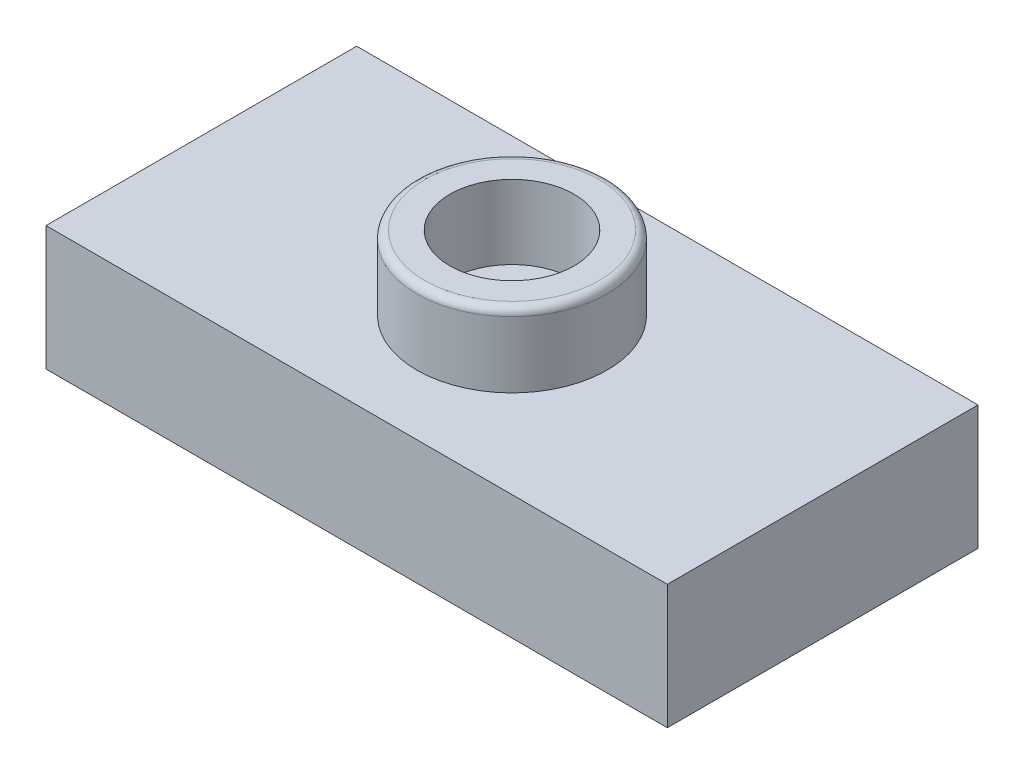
ISO-10303-21;
HEADER;
FILE_DESCRIPTION(('STEP AP214'),'2;1');
FILE_NAME('part.step','',(''),(''),'','','');
FILE_SCHEMA(('AUTOMOTIVE_DESIGN { 1 0 10303 214 1 1 1 1 }'));
ENDSEC;
DATA;
#1=APPLICATION_CONTEXT('core data for automotive mechanical design processes');
#2=APPLICATION_PROTOCOL_DEFINITION('international standard','automotive_design',2000,#1);
#3=PRODUCT_CONTEXT('',#1,'mechanical');
#4=PRODUCT('Part','Part','',(#3));
#5=PRODUCT_RELATED_PRODUCT_CATEGORY('part','',(#4));
#6=PRODUCT_DEFINITION_FORMATION('','',#4);
#7=PRODUCT_DEFINITION_CONTEXT('part definition',#1,'design');
#8=PRODUCT_DEFINITION('design','',#6,#7);
#9=PRODUCT_DEFINITION_SHAPE('','',#8);
#10=(LENGTH_UNIT() NAMED_UNIT(*) SI_UNIT(.MILLI.,.METRE.));
#11=(NAMED_UNIT(*) PLANE_ANGLE_UNIT() SI_UNIT($,.RADIAN.));
#12=(NAMED_UNIT(*) SI_UNIT($,.STERADIAN.) SOLID_ANGLE_UNIT());
#13=UNCERTAINTY_MEASURE_WITH_UNIT(LENGTH_MEASURE(1.E-05),#10,'distance_accuracy_value','');
#14=(GEOMETRIC_REPRESENTATION_CONTEXT(3) GLOBAL_UNCERTAINTY_ASSIGNED_CONTEXT((#13)) GLOBAL_UNIT_ASSIGNED_CONTEXT((#10,
#11,#12)) REPRESENTATION_CONTEXT('',''));
#15=CARTESIAN_POINT('',(0.,0.,0.));
#16=DIRECTION('',(0.,0.,1.));
#17=DIRECTION('',(1.,0.,0.));
#18=AXIS2_PLACEMENT_3D('',#15,#16,#17);
#19=CARTESIAN_POINT('',(0.,3.2,-8.));
#20=DIRECTION('',(0.,-1.,0.));
#21=DIRECTION('',(0.,0.,-1.));
#22=AXIS2_PLACEMENT_3D('',#19,#20,#21);
#23=PLANE('',#22);
#24=DIRECTION('',(0.,0.,1.));
#25=VECTOR('',#24,1.);
#26=CARTESIAN_POINT('',(0.,3.2,0.));
#27=LINE('',#26,#25);
#28=CARTESIAN_POINT('',(0.,3.2,-8.));
#29=VERTEX_POINT('',#28);
#30=CARTESIAN_POINT('',(0.,3.2,0.));
#31=VERTEX_POINT('',#30);
#32=EDGE_CURVE('E141',#29,#31,#27,.T.);
#33=ORIENTED_EDGE('',*,*,#32,.T.);
#34=DIRECTION('',(1.,0.,0.));
#35=VECTOR('',#34,1.);
#36=CARTESIAN_POINT('',(0.,3.2,0.));
#37=LINE('',#36,#35);
#38=CARTESIAN_POINT('',(16.,3.2,0.));
#39=VERTEX_POINT('',#38);
#40=EDGE_CURVE('E143',#31,#39,#37,.T.);
#41=ORIENTED_EDGE('',*,*,#40,.T.);
#42=DIRECTION('',(0.,0.,-1.));
#43=VECTOR('',#42,1.);
#44=CARTESIAN_POINT('',(16.,3.2,0.));
#45=LINE('',#44,#43);
#46=CARTESIAN_POINT('',(16.,3.2,-8.));
#47=VERTEX_POINT('',#46);
#48=EDGE_CURVE('E145',#39,#47,#45,.T.);
#49=ORIENTED_EDGE('',*,*,#48,.T.);
#50=DIRECTION('',(-1.,0.,0.));
#51=VECTOR('',#50,1.);
#52=CARTESIAN_POINT('',(0.,3.2,-8.));
#53=LINE('',#52,#51);
#54=EDGE_CURVE('E49',#47,#29,#53,.T.);
#55=ORIENTED_EDGE('',*,*,#54,.T.);
#56=EDGE_LOOP('',(#33,#41,#49,#55));
#57=FACE_BOUND('',#56,.T.);
#58=CARTESIAN_POINT('',(8.,3.2,-4.));
#59=DIRECTION('',(0.,-1.,0.));
#60=DIRECTION('',(0.,0.,-1.));
#61=AXIS2_PLACEMENT_3D('',#58,#59,#60);
#62=CIRCLE('',#61,2.45);
#63=CARTESIAN_POINT('',(8.,3.2,-6.45));
#64=VERTEX_POINT('',#63);
#65=EDGE_CURVE('E166',#64,#64,#62,.F.);
#66=ORIENTED_EDGE('',*,*,#65,.F.);
#67=EDGE_LOOP('',(#66));
#68=FACE_BOUND('',#67,.T.);
#69=ADVANCED_FACE('F26',(#57,#68),#23,.F.);
#70=CARTESIAN_POINT('',(1.6,2.1,-6.4));
#71=DIRECTION('',(0.,-1.,0.));
#72=DIRECTION('',(0.,0.,-1.));
#73=AXIS2_PLACEMENT_3D('',#70,#71,#72);
#74=PLANE('',#73);
#75=DIRECTION('',(0.,0.,-1.));
#76=VECTOR('',#75,1.);
#77=CARTESIAN_POINT('',(1.6,2.1,-1.6));
#78=LINE('',#77,#76);
#79=CARTESIAN_POINT('',(1.6,2.1,-1.6));
#80=VERTEX_POINT('',#79);
#81=CARTESIAN_POINT('',(1.6,2.1,-6.4));
#82=VERTEX_POINT('',#81);
#83=EDGE_CURVE('E116',#80,#82,#78,.T.);
#84=ORIENTED_EDGE('',*,*,#83,.T.);
#85=DIRECTION('',(1.,0.,0.));
#86=VECTOR('',#85,1.);
#87=CARTESIAN_POINT('',(1.6,2.1,-6.4));
#88=LINE('',#87,#86);
#89=CARTESIAN_POINT('',(14.4,2.1,-6.4));
#90=VERTEX_POINT('',#89);
#91=EDGE_CURVE('E122',#82,#90,#88,.T.);
#92=ORIENTED_EDGE('',*,*,#91,.T.);
#93=DIRECTION('',(0.,0.,1.));
#94=VECTOR('',#93,1.);
#95=CARTESIAN_POINT('',(14.4,2.1,-1.6));
#96=LINE('',#95,#94);
#97=CARTESIAN_POINT('',(14.4,2.1,-1.6));
#98=VERTEX_POINT('',#97);
#99=EDGE_CURVE('E99',#90,#98,#96,.T.);
#100=ORIENTED_EDGE('',*,*,#99,.T.);
#101=DIRECTION('',(-1.,0.,0.));
#102=VECTOR('',#101,1.);
#103=CARTESIAN_POINT('',(1.6,2.1,-1.6));
#104=LINE('',#103,#102);
#105=EDGE_CURVE('E125',#98,#80,#104,.T.);
#106=ORIENTED_EDGE('',*,*,#105,.T.);
#107=EDGE_LOOP('',(#84,#92,#100,#106));
#108=FACE_BOUND('',#107,.T.);
#109=CARTESIAN_POINT('',(8.,2.1,-4.));
#110=DIRECTION('',(0.,-1.,0.));
#111=DIRECTION('',(0.,0.,-1.));
#112=AXIS2_PLACEMENT_3D('',#109,#110,#111);
#113=CIRCLE('',#112,1.6);
#114=CARTESIAN_POINT('',(8.,2.1,-2.4));
#115=VERTEX_POINT('',#114);
#116=EDGE_CURVE('E282',#115,#115,#113,.T.);
#117=ORIENTED_EDGE('',*,*,#116,.F.);
#118=EDGE_LOOP('',(#117));
#119=FACE_BOUND('',#118,.T.);
#120=ADVANCED_FACE('F191',(#108,#119),#74,.T.);
#121=CARTESIAN_POINT('',(0.,3.2,0.));
#122=DIRECTION('',(1.,0.,0.));
#123=DIRECTION('',(0.,0.,-1.));
#124=AXIS2_PLACEMENT_3D('',#121,#122,#123);
#125=PLANE('',#124);
#126=DIRECTION('',(0.,0.,1.));
#127=VECTOR('',#126,1.);
#128=CARTESIAN_POINT('',(0.,0.,0.));
#129=LINE('',#128,#127);
#130=CARTESIAN_POINT('',(0.,0.,-8.));
#131=VERTEX_POINT('',#130);
#132=CARTESIAN_POINT('',(0.,0.,0.));
#133=VERTEX_POINT('',#132);
#134=EDGE_CURVE('E130',#131,#133,#129,.T.);
#135=ORIENTED_EDGE('',*,*,#134,.T.);
#136=DIRECTION('',(0.,-1.,0.));
#137=VECTOR('',#136,1.);
#138=CARTESIAN_POINT('',(0.,3.2,0.));
#139=LINE('',#138,#137);
#140=EDGE_CURVE('E157',#31,#133,#139,.T.);
#141=ORIENTED_EDGE('',*,*,#140,.F.);
#142=ORIENTED_EDGE('',*,*,#32,.F.);
#143=DIRECTION('',(0.,-1.,0.));
#144=VECTOR('',#143,1.);
#145=CARTESIAN_POINT('',(0.,3.2,-8.));
#146=LINE('',#145,#144);
#147=EDGE_CURVE('E148',#29,#131,#146,.T.);
#148=ORIENTED_EDGE('',*,*,#147,.T.);
#149=EDGE_LOOP('',(#135,#141,#142,#148));
#150=FACE_BOUND('',#149,.T.);
#151=ADVANCED_FACE('F28',(#150),#125,.F.);
#152=CARTESIAN_POINT('',(0.,3.2,0.));
#153=DIRECTION('',(0.,0.,-1.));
#154=DIRECTION('',(-1.,0.,0.));
#155=AXIS2_PLACEMENT_3D('',#152,#153,#154);
#156=PLANE('',#155);
#157=DIRECTION('',(1.,0.,0.));
#158=VECTOR('',#157,1.);
#159=CARTESIAN_POINT('',(0.,0.,0.));
#160=LINE('',#159,#158);
#161=CARTESIAN_POINT('',(16.,0.,0.));
#162=VERTEX_POINT('',#161);
#163=EDGE_CURVE('E135',#133,#162,#160,.T.);
#164=ORIENTED_EDGE('',*,*,#163,.T.);
#165=DIRECTION('',(0.,-1.,0.));
#166=VECTOR('',#165,1.);
#167=CARTESIAN_POINT('',(16.,3.2,0.));
#168=LINE('',#167,#166);
#169=EDGE_CURVE('E154',#39,#162,#168,.T.);
#170=ORIENTED_EDGE('',*,*,#169,.F.);
#171=ORIENTED_EDGE('',*,*,#40,.F.);
#172=ORIENTED_EDGE('',*,*,#140,.T.);
#173=EDGE_LOOP('',(#164,#170,#171,#172));
#174=FACE_BOUND('',#173,.T.);
#175=ADVANCED_FACE('F209',(#174),#156,.F.);
#176=CARTESIAN_POINT('',(16.,3.2,0.));
#177=DIRECTION('',(-1.,0.,0.));
#178=DIRECTION('',(0.,0.,1.));
#179=AXIS2_PLACEMENT_3D('',#176,#177,#178);
#180=PLANE('',#179);
#181=DIRECTION('',(0.,0.,-1.));
#182=VECTOR('',#181,1.);
#183=CARTESIAN_POINT('',(16.,0.,0.));
#184=LINE('',#183,#182);
#185=CARTESIAN_POINT('',(16.,0.,-8.));
#186=VERTEX_POINT('',#185);
#187=EDGE_CURVE('E137',#162,#186,#184,.T.);
#188=ORIENTED_EDGE('',*,*,#187,.T.);
#189=DIRECTION('',(0.,-1.,0.));
#190=VECTOR('',#189,1.);
#191=CARTESIAN_POINT('',(16.,3.2,-8.));
#192=LINE('',#191,#190);
#193=EDGE_CURVE('E151',#47,#186,#192,.T.);
#194=ORIENTED_EDGE('',*,*,#193,.F.);
#195=ORIENTED_EDGE('',*,*,#48,.F.);
#196=ORIENTED_EDGE('',*,*,#169,.T.);
#197=EDGE_LOOP('',(#188,#194,#195,#196));
#198=FACE_BOUND('',#197,.T.);
#199=ADVANCED_FACE('F206',(#198),#180,.F.);
#200=CARTESIAN_POINT('',(0.,3.2,-8.));
#201=DIRECTION('',(0.,0.,1.));
#202=DIRECTION('',(1.,0.,0.));
#203=AXIS2_PLACEMENT_3D('',#200,#201,#202);
#204=PLANE('',#203);
#205=DIRECTION('',(-1.,0.,0.));
#206=VECTOR('',#205,1.);
#207=CARTESIAN_POINT('',(0.,0.,-8.));
#208=LINE('',#207,#206);
#209=EDGE_CURVE('E139',#186,#131,#208,.T.);
#210=ORIENTED_EDGE('',*,*,#209,.T.);
#211=ORIENTED_EDGE('',*,*,#147,.F.);
#212=ORIENTED_EDGE('',*,*,#54,.F.);
#213=ORIENTED_EDGE('',*,*,#193,.T.);
#214=EDGE_LOOP('',(#210,#211,#212,#213));
#215=FACE_BOUND('',#214,.T.);
#216=ADVANCED_FACE('F203',(#215),#204,.F.);
#217=CARTESIAN_POINT('',(0.,0.,-8.));
#218=DIRECTION('',(0.,-1.,0.));
#219=DIRECTION('',(0.,0.,-1.));
#220=AXIS2_PLACEMENT_3D('',#217,#218,#219);
#221=PLANE('',#220);
#222=DIRECTION('',(0.,0.,-1.));
#223=VECTOR('',#222,1.);
#224=CARTESIAN_POINT('',(1.6,0.,-1.6));
#225=LINE('',#224,#223);
#226=CARTESIAN_POINT('',(1.6,0.,-1.6));
#227=VERTEX_POINT('',#226);
#228=CARTESIAN_POINT('',(1.6,0.,-6.4));
#229=VERTEX_POINT('',#228);
#230=EDGE_CURVE('E41',#227,#229,#225,.T.);
#231=ORIENTED_EDGE('',*,*,#230,.F.);
#232=DIRECTION('',(-1.,0.,0.));
#233=VECTOR('',#232,1.);
#234=CARTESIAN_POINT('',(1.6,0.,-1.6));
#235=LINE('',#234,#233);
#236=CARTESIAN_POINT('',(14.4,0.,-1.6));
#237=VERTEX_POINT('',#236);
#238=EDGE_CURVE('E114',#237,#227,#235,.T.);
#239=ORIENTED_EDGE('',*,*,#238,.F.);
#240=DIRECTION('',(0.,0.,1.));
#241=VECTOR('',#240,1.);
#242=CARTESIAN_POINT('',(14.4,0.,-1.6));
#243=LINE('',#242,#241);
#244=CARTESIAN_POINT('',(14.4,0.,-6.4));
#245=VERTEX_POINT('',#244);
#246=EDGE_CURVE('E96',#245,#237,#243,.T.);
#247=ORIENTED_EDGE('',*,*,#246,.F.);
#248=DIRECTION('',(1.,0.,0.));
#249=VECTOR('',#248,1.);
#250=CARTESIAN_POINT('',(1.6,0.,-6.4));
#251=LINE('',#250,#249);
#252=EDGE_CURVE('E107',#229,#245,#251,.T.);
#253=ORIENTED_EDGE('',*,*,#252,.F.);
#254=EDGE_LOOP('',(#231,#239,#247,#253));
#255=FACE_BOUND('',#254,.T.);
#256=ORIENTED_EDGE('',*,*,#134,.F.);
#257=ORIENTED_EDGE('',*,*,#209,.F.);
#258=ORIENTED_EDGE('',*,*,#187,.F.);
#259=ORIENTED_EDGE('',*,*,#163,.F.);
#260=EDGE_LOOP('',(#256,#257,#258,#259));
#261=FACE_BOUND('',#260,.T.);
#262=ADVANCED_FACE('F111',(#255,#261),#221,.T.);
#263=CARTESIAN_POINT('',(1.6,2.1,-1.6));
#264=DIRECTION('',(-1.,0.,0.));
#265=DIRECTION('',(0.,0.,1.));
#266=AXIS2_PLACEMENT_3D('',#263,#264,#265);
#267=PLANE('',#266);
#268=ORIENTED_EDGE('',*,*,#230,.T.);
#269=DIRECTION('',(0.,-1.,0.));
#270=VECTOR('',#269,1.);
#271=CARTESIAN_POINT('',(1.6,2.1,-6.4));
#272=LINE('',#271,#270);
#273=EDGE_CURVE('E104',#82,#229,#272,.T.);
#274=ORIENTED_EDGE('',*,*,#273,.F.);
#275=ORIENTED_EDGE('',*,*,#83,.F.);
#276=DIRECTION('',(0.,-1.,0.));
#277=VECTOR('',#276,1.);
#278=CARTESIAN_POINT('',(1.6,2.1,-1.6));
#279=LINE('',#278,#277);
#280=EDGE_CURVE('E128',#80,#227,#279,.T.);
#281=ORIENTED_EDGE('',*,*,#280,.T.);
#282=EDGE_LOOP('',(#268,#274,#275,#281));
#283=FACE_BOUND('',#282,.T.);
#284=ADVANCED_FACE('F226',(#283),#267,.F.);
#285=CARTESIAN_POINT('',(1.6,2.1,-1.6));
#286=DIRECTION('',(0.,0.,1.));
#287=DIRECTION('',(1.,0.,0.));
#288=AXIS2_PLACEMENT_3D('',#285,#286,#287);
#289=PLANE('',#288);
#290=ORIENTED_EDGE('',*,*,#238,.T.);
#291=ORIENTED_EDGE('',*,*,#280,.F.);
#292=ORIENTED_EDGE('',*,*,#105,.F.);
#293=DIRECTION('',(0.,-1.,0.));
#294=VECTOR('',#293,1.);
#295=CARTESIAN_POINT('',(14.4,2.1,-1.6));
#296=LINE('',#295,#294);
#297=EDGE_CURVE('E103',#98,#237,#296,.T.);
#298=ORIENTED_EDGE('',*,*,#297,.T.);
#299=EDGE_LOOP('',(#290,#291,#292,#298));
#300=FACE_BOUND('',#299,.T.);
#301=ADVANCED_FACE('F230',(#300),#289,.F.);
#302=CARTESIAN_POINT('',(14.4,2.1,-1.6));
#303=DIRECTION('',(1.,0.,0.));
#304=DIRECTION('',(0.,0.,-1.));
#305=AXIS2_PLACEMENT_3D('',#302,#303,#304);
#306=PLANE('',#305);
#307=ORIENTED_EDGE('',*,*,#246,.T.);
#308=ORIENTED_EDGE('',*,*,#297,.F.);
#309=ORIENTED_EDGE('',*,*,#99,.F.);
#310=DIRECTION('',(0.,-1.,0.));
#311=VECTOR('',#310,1.);
#312=CARTESIAN_POINT('',(14.4,2.1,-6.4));
#313=LINE('',#312,#311);
#314=EDGE_CURVE('E92',#90,#245,#313,.T.);
#315=ORIENTED_EDGE('',*,*,#314,.T.);
#316=EDGE_LOOP('',(#307,#308,#309,#315));
#317=FACE_BOUND('',#316,.T.);
#318=ADVANCED_FACE('F94',(#317),#306,.F.);
#319=CARTESIAN_POINT('',(1.6,2.1,-6.4));
#320=DIRECTION('',(0.,0.,-1.));
#321=DIRECTION('',(-1.,0.,0.));
#322=AXIS2_PLACEMENT_3D('',#319,#320,#321);
#323=PLANE('',#322);
#324=ORIENTED_EDGE('',*,*,#252,.T.);
#325=ORIENTED_EDGE('',*,*,#314,.F.);
#326=ORIENTED_EDGE('',*,*,#91,.F.);
#327=ORIENTED_EDGE('',*,*,#273,.T.);
#328=EDGE_LOOP('',(#324,#325,#326,#327));
#329=FACE_BOUND('',#328,.T.);
#330=ADVANCED_FACE('F108',(#329),#323,.F.);
#331=CARTESIAN_POINT('',(8.,0.2,-4.));
#332=DIRECTION('',(0.,1.,0.));
#333=DIRECTION('',(0.,0.,1.));
#334=AXIS2_PLACEMENT_3D('',#331,#332,#333);
#335=CYLINDRICAL_SURFACE('',#334,1.6);
#336=CARTESIAN_POINT('',(8.,0.4,-4.));
#337=DIRECTION('',(0.,-1.,0.));
#338=DIRECTION('',(0.,0.,-1.));
#339=AXIS2_PLACEMENT_3D('',#336,#337,#338);
#340=CIRCLE('',#339,1.6);
#341=CARTESIAN_POINT('',(8.,0.4,-2.4));
#342=VERTEX_POINT('',#341);
#343=EDGE_CURVE('E163',#342,#342,#340,.F.);
#344=CARTESIAN_POINT('',(8.,0.4,-2.4));
#345=CARTESIAN_POINT('',(8.,0.417708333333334,-2.4));
#346=CARTESIAN_POINT('',(8.,0.435416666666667,-2.4));
#347=CARTESIAN_POINT('',(8.,0.470833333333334,-2.4));
#348=CARTESIAN_POINT('',(8.,0.488541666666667,-2.4));
#349=CARTESIAN_POINT('',(8.,0.523958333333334,-2.4));
#350=CARTESIAN_POINT('',(8.,0.541666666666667,-2.4));
#351=CARTESIAN_POINT('',(8.,0.577083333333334,-2.4));
#352=CARTESIAN_POINT('',(8.,0.594791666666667,-2.4));
#353=CARTESIAN_POINT('',(8.,0.630208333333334,-2.4));
#354=CARTESIAN_POINT('',(8.,0.647916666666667,-2.4));
#355=CARTESIAN_POINT('',(8.,0.683333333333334,-2.4));
#356=CARTESIAN_POINT('',(8.,0.701041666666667,-2.4));
#357=CARTESIAN_POINT('',(8.,0.736458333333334,-2.4));
#358=CARTESIAN_POINT('',(8.,0.754166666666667,-2.4));
#359=CARTESIAN_POINT('',(8.,0.789583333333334,-2.4));
#360=CARTESIAN_POINT('',(8.,0.807291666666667,-2.4));
#361=CARTESIAN_POINT('',(8.,0.842708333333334,-2.4));
#362=CARTESIAN_POINT('',(8.,0.860416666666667,-2.4));
#363=CARTESIAN_POINT('',(8.,0.895833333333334,-2.4));
#364=CARTESIAN_POINT('',(8.,0.913541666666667,-2.4));
#365=CARTESIAN_POINT('',(8.,0.948958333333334,-2.4));
#366=CARTESIAN_POINT('',(8.,0.966666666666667,-2.4));
#367=CARTESIAN_POINT('',(8.,1.00208333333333,-2.4));
#368=CARTESIAN_POINT('',(8.,1.01979166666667,-2.4));
#369=CARTESIAN_POINT('',(8.,1.05520833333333,-2.4));
#370=CARTESIAN_POINT('',(8.,1.07291666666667,-2.4));
#371=CARTESIAN_POINT('',(8.,1.10833333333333,-2.4));
#372=CARTESIAN_POINT('',(8.,1.12604166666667,-2.4));
#373=CARTESIAN_POINT('',(8.,1.16145833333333,-2.4));
#374=CARTESIAN_POINT('',(8.,1.17916666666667,-2.4));
#375=CARTESIAN_POINT('',(8.,1.21458333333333,-2.4));
#376=CARTESIAN_POINT('',(8.,1.23229166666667,-2.4));
#377=CARTESIAN_POINT('',(8.,1.26770833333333,-2.4));
#378=CARTESIAN_POINT('',(8.,1.28541666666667,-2.4));
#379=CARTESIAN_POINT('',(8.,1.32083333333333,-2.4));
#380=CARTESIAN_POINT('',(8.,1.33854166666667,-2.4));
#381=CARTESIAN_POINT('',(8.,1.37395833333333,-2.4));
#382=CARTESIAN_POINT('',(8.,1.39166666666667,-2.4));
#383=CARTESIAN_POINT('',(8.,1.42708333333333,-2.4));
#384=CARTESIAN_POINT('',(8.,1.44479166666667,-2.4));
#385=CARTESIAN_POINT('',(8.,1.48020833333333,-2.4));
#386=CARTESIAN_POINT('',(8.,1.49791666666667,-2.4));
#387=CARTESIAN_POINT('',(8.,1.53333333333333,-2.4));
#388=CARTESIAN_POINT('',(8.,1.55104166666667,-2.4));
#389=CARTESIAN_POINT('',(8.,1.58645833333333,-2.4));
#390=CARTESIAN_POINT('',(8.,1.60416666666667,-2.4));
#391=CARTESIAN_POINT('',(8.,1.63958333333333,-2.4));
#392=CARTESIAN_POINT('',(8.,1.65729166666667,-2.4));
#393=CARTESIAN_POINT('',(8.,1.69270833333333,-2.4));
#394=CARTESIAN_POINT('',(8.,1.71041666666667,-2.4));
#395=CARTESIAN_POINT('',(8.,1.74583333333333,-2.4));
#396=CARTESIAN_POINT('',(8.,1.76354166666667,-2.4));
#397=CARTESIAN_POINT('',(8.,1.79895833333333,-2.4));
#398=CARTESIAN_POINT('',(8.,1.81666666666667,-2.4));
#399=CARTESIAN_POINT('',(8.,1.85208333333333,-2.4));
#400=CARTESIAN_POINT('',(8.,1.86979166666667,-2.4));
#401=CARTESIAN_POINT('',(8.,1.90520833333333,-2.4));
#402=CARTESIAN_POINT('',(8.,1.92291666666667,-2.4));
#403=CARTESIAN_POINT('',(8.,1.95833333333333,-2.4));
#404=CARTESIAN_POINT('',(8.,1.97604166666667,-2.4));
#405=CARTESIAN_POINT('',(8.,2.01145833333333,-2.4));
#406=CARTESIAN_POINT('',(8.,2.02916666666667,-2.4));
#407=CARTESIAN_POINT('',(8.,2.06458333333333,-2.4));
#408=CARTESIAN_POINT('',(8.,2.08229166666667,-2.4));
#409=CARTESIAN_POINT('',(8.,2.1,-2.4));
#410=B_SPLINE_CURVE_WITH_KNOTS('',3,(#344,#345,#346,#347,#348,#349,#350,#351,#352,#353,#354,
#355,#356,#357,#358,#359,#360,#361,#362,#363,#364,#365,#366,#367,#368,#369,#370,#371,#372,#373,
#374,#375,#376,#377,#378,#379,#380,#381,#382,#383,#384,#385,#386,#387,#388,#389,#390,#391,#392,
#393,#394,#395,#396,#397,#398,#399,#400,#401,#402,#403,#404,#405,#406,#407,#408,#409),
.UNSPECIFIED.,.F.,.F.,(4,2,2,2,2,2,2,2,2,2,2,2,2,2,2,2,2,2,2,2,2,2,2,2,2,2,2,2,2,2,2,2,4),(0.,
0.053125,0.10625,0.159375,0.2125,0.265625,0.31875,0.371875,0.425,0.478125,0.53125,0.584375,
0.6375,0.690625,0.74375,0.796875,0.85,0.903125,0.95625,1.009375,1.0625,1.115625,1.16875,
1.221875,1.275,1.328125,1.38125,1.434375,1.4875,1.540625,1.59375,1.646875,1.7),.UNSPECIFIED.);
#411=EDGE_CURVE('BSEAM239',#342,#115,#410,.T.);
#412=ORIENTED_EDGE('',*,*,#343,.T.);
#413=ORIENTED_EDGE('',*,*,#116,.T.);
#414=ORIENTED_EDGE('',*,*,#411,.T.);
#415=ORIENTED_EDGE('',*,*,#411,.F.);
#416=EDGE_LOOP('',(#412,#414,#413,#415));
#417=FACE_BOUND('',#416,.T.);
#418=ADVANCED_FACE('F239',(#417),#335,.T.);
#419=CARTESIAN_POINT('',(8.,0.2,-4.));
#420=DIRECTION('',(0.,-1.,0.));
#421=DIRECTION('',(0.,0.,-1.));
#422=AXIS2_PLACEMENT_3D('',#419,#420,#421);
#423=PLANE('',#422);
#424=CARTESIAN_POINT('',(8.,0.2,-4.));
#425=DIRECTION('',(0.,-1.,0.));
#426=DIRECTION('',(0.,0.,-1.));
#427=AXIS2_PLACEMENT_3D('',#424,#425,#426);
#428=CIRCLE('',#427,1.4);
#429=CARTESIAN_POINT('',(8.,0.2,-5.4));
#430=VERTEX_POINT('',#429);
#431=EDGE_CURVE('E160',#430,#430,#428,.T.);
#432=ORIENTED_EDGE('',*,*,#431,.T.);
#433=EDGE_LOOP('',(#432));
#434=FACE_BOUND('',#433,.T.);
#435=ADVANCED_FACE('F244',(#434),#423,.T.);
#436=CARTESIAN_POINT('',(8.,0.4,-4.));
#437=DIRECTION('',(0.,-1.,0.));
#438=DIRECTION('',(0.,0.,-1.));
#439=AXIS2_PLACEMENT_3D('',#436,#437,#438);
#440=TOROIDAL_SURFACE('',#439,1.4,0.2);
#441=ORIENTED_EDGE('',*,*,#343,.F.);
#442=EDGE_LOOP('',(#441));
#443=FACE_BOUND('',#442,.T.);
#444=ORIENTED_EDGE('',*,*,#431,.F.);
#445=EDGE_LOOP('',(#444));
#446=FACE_BOUND('',#445,.T.);
#447=ADVANCED_FACE('F248',(#443,#446),#440,.T.);
#448=CARTESIAN_POINT('',(8.,5.1,-4.));
#449=DIRECTION('',(0.,-1.,0.));
#450=DIRECTION('',(0.,0.,-1.));
#451=AXIS2_PLACEMENT_3D('',#448,#449,#450);
#452=CYLINDRICAL_SURFACE('',#451,2.45);
#453=CARTESIAN_POINT('',(8.,4.9,-4.));
#454=DIRECTION('',(0.,1.,0.));
#455=DIRECTION('',(0.,0.,1.));
#456=AXIS2_PLACEMENT_3D('',#453,#454,#455);
#457=CIRCLE('',#456,2.45);
#458=CARTESIAN_POINT('',(8.,4.9,-6.45));
#459=VERTEX_POINT('',#458);
#460=EDGE_CURVE('E11',#459,#459,#457,.F.);
#461=CARTESIAN_POINT('',(8.,4.9,-6.45));
#462=CARTESIAN_POINT('',(8.,4.88229166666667,-6.45));
#463=CARTESIAN_POINT('',(8.,4.86458333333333,-6.45));
#464=CARTESIAN_POINT('',(8.,4.82916666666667,-6.45));
#465=CARTESIAN_POINT('',(8.,4.81145833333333,-6.45));
#466=CARTESIAN_POINT('',(8.,4.77604166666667,-6.45));
#467=CARTESIAN_POINT('',(8.,4.75833333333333,-6.45));
#468=CARTESIAN_POINT('',(8.,4.72291666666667,-6.45));
#469=CARTESIAN_POINT('',(8.,4.70520833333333,-6.45));
#470=CARTESIAN_POINT('',(8.,4.66979166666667,-6.45));
#471=CARTESIAN_POINT('',(8.,4.65208333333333,-6.45));
#472=CARTESIAN_POINT('',(8.,4.61666666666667,-6.45));
#473=CARTESIAN_POINT('',(8.,4.59895833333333,-6.45));
#474=CARTESIAN_POINT('',(8.,4.56354166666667,-6.45));
#475=CARTESIAN_POINT('',(8.,4.54583333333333,-6.45));
#476=CARTESIAN_POINT('',(8.,4.51041666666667,-6.45));
#477=CARTESIAN_POINT('',(8.,4.49270833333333,-6.45));
#478=CARTESIAN_POINT('',(8.,4.45729166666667,-6.45));
#479=CARTESIAN_POINT('',(8.,4.43958333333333,-6.45));
#480=CARTESIAN_POINT('',(8.,4.40416666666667,-6.45));
#481=CARTESIAN_POINT('',(8.,4.38645833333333,-6.45));
#482=CARTESIAN_POINT('',(8.,4.35104166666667,-6.45));
#483=CARTESIAN_POINT('',(8.,4.33333333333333,-6.45));
#484=CARTESIAN_POINT('',(8.,4.29791666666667,-6.45));
#485=CARTESIAN_POINT('',(8.,4.28020833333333,-6.45));
#486=CARTESIAN_POINT('',(8.,4.24479166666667,-6.45));
#487=CARTESIAN_POINT('',(8.,4.22708333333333,-6.45));
#488=CARTESIAN_POINT('',(8.,4.19166666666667,-6.45));
#489=CARTESIAN_POINT('',(8.,4.17395833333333,-6.45));
#490=CARTESIAN_POINT('',(8.,4.13854166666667,-6.45));
#491=CARTESIAN_POINT('',(8.,4.12083333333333,-6.45));
#492=CARTESIAN_POINT('',(8.,4.08541666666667,-6.45));
#493=CARTESIAN_POINT('',(8.,4.06770833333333,-6.45));
#494=CARTESIAN_POINT('',(8.,4.03229166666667,-6.45));
#495=CARTESIAN_POINT('',(8.,4.01458333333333,-6.45));
#496=CARTESIAN_POINT('',(8.,3.97916666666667,-6.45));
#497=CARTESIAN_POINT('',(8.,3.96145833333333,-6.45));
#498=CARTESIAN_POINT('',(8.,3.92604166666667,-6.45));
#499=CARTESIAN_POINT('',(8.,3.90833333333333,-6.45));
#500=CARTESIAN_POINT('',(8.,3.87291666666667,-6.45));
#501=CARTESIAN_POINT('',(8.,3.85520833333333,-6.45));
#502=CARTESIAN_POINT('',(8.,3.81979166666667,-6.45));
#503=CARTESIAN_POINT('',(8.,3.80208333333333,-6.45));
#504=CARTESIAN_POINT('',(8.,3.76666666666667,-6.45));
#505=CARTESIAN_POINT('',(8.,3.74895833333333,-6.45));
#506=CARTESIAN_POINT('',(8.,3.71354166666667,-6.45));
#507=CARTESIAN_POINT('',(8.,3.69583333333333,-6.45));
#508=CARTESIAN_POINT('',(8.,3.66041666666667,-6.45));
#509=CARTESIAN_POINT('',(8.,3.64270833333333,-6.45));
#510=CARTESIAN_POINT('',(8.,3.60729166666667,-6.45));
#511=CARTESIAN_POINT('',(8.,3.58958333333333,-6.45));
#512=CARTESIAN_POINT('',(8.,3.55416666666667,-6.45));
#513=CARTESIAN_POINT('',(8.,3.53645833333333,-6.45));
#514=CARTESIAN_POINT('',(8.,3.50104166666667,-6.45));
#515=CARTESIAN_POINT('',(8.,3.48333333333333,-6.45));
#516=CARTESIAN_POINT('',(8.,3.44791666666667,-6.45));
#517=CARTESIAN_POINT('',(8.,3.43020833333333,-6.45));
#518=CARTESIAN_POINT('',(8.,3.39479166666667,-6.45));
#519=CARTESIAN_POINT('',(8.,3.37708333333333,-6.45));
#520=CARTESIAN_POINT('',(8.,3.34166666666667,-6.45));
#521=CARTESIAN_POINT('',(8.,3.32395833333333,-6.45));
#522=CARTESIAN_POINT('',(8.,3.28854166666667,-6.45));
#523=CARTESIAN_POINT('',(8.,3.27083333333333,-6.45));
#524=CARTESIAN_POINT('',(8.,3.23541666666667,-6.45));
#525=CARTESIAN_POINT('',(8.,3.21770833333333,-6.45));
#526=CARTESIAN_POINT('',(8.,3.2,-6.45));
#527=B_SPLINE_CURVE_WITH_KNOTS('',3,(#461,#462,#463,#464,#465,#466,#467,#468,#469,#470,#471,
#472,#473,#474,#475,#476,#477,#478,#479,#480,#481,#482,#483,#484,#485,#486,#487,#488,#489,#490,
#491,#492,#493,#494,#495,#496,#497,#498,#499,#500,#501,#502,#503,#504,#505,#506,#507,#508,#509,
#510,#511,#512,#513,#514,#515,#516,#517,#518,#519,#520,#521,#522,#523,#524,#525,#526),
.UNSPECIFIED.,.F.,.F.,(4,2,2,2,2,2,2,2,2,2,2,2,2,2,2,2,2,2,2,2,2,2,2,2,2,2,2,2,2,2,2,2,4),(0.,
0.0531250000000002,0.10625,0.159375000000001,0.2125,0.265625,0.31875,0.371875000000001,0.425,
0.478125,0.53125,0.584375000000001,0.6375,0.690625,0.74375,0.796875,0.85,0.903125,0.95625,
1.009375,1.0625,1.115625,1.16875,1.221875,1.275,1.328125,1.38125,1.434375,1.4875,1.540625,
1.59375,1.646875,1.7),.UNSPECIFIED.);
#528=EDGE_CURVE('BSEAM186',#459,#64,#527,.T.);
#529=ORIENTED_EDGE('',*,*,#460,.T.);
#530=ORIENTED_EDGE('',*,*,#65,.T.);
#531=ORIENTED_EDGE('',*,*,#528,.T.);
#532=ORIENTED_EDGE('',*,*,#528,.F.);
#533=EDGE_LOOP('',(#529,#531,#530,#532));
#534=FACE_BOUND('',#533,.T.);
#535=ADVANCED_FACE('F186',(#534),#452,.T.);
#536=CARTESIAN_POINT('',(8.,5.1,-4.));
#537=DIRECTION('',(0.,1.,0.));
#538=DIRECTION('',(0.,0.,1.));
#539=AXIS2_PLACEMENT_3D('',#536,#537,#538);
#540=PLANE('',#539);
#541=CARTESIAN_POINT('',(8.,5.1,-4.));
#542=DIRECTION('',(0.,1.,0.));
#543=DIRECTION('',(0.,0.,1.));
#544=AXIS2_PLACEMENT_3D('',#541,#542,#543);
#545=CIRCLE('',#544,1.6);
#546=CARTESIAN_POINT('',(8.,5.1,-2.4));
#547=VERTEX_POINT('',#546);
#548=EDGE_CURVE('E283',#547,#547,#545,.T.);
#549=ORIENTED_EDGE('',*,*,#548,.F.);
#550=EDGE_LOOP('',(#549));
#551=FACE_BOUND('',#550,.T.);
#552=CARTESIAN_POINT('',(8.,5.1,-4.));
#553=DIRECTION('',(0.,1.,0.));
#554=DIRECTION('',(0.,0.,1.));
#555=AXIS2_PLACEMENT_3D('',#552,#553,#554);
#556=CIRCLE('',#555,2.25);
#557=CARTESIAN_POINT('',(8.,5.1,-1.75));
#558=VERTEX_POINT('',#557);
#559=EDGE_CURVE('E34',#558,#558,#556,.T.);
#560=ORIENTED_EDGE('',*,*,#559,.T.);
#561=EDGE_LOOP('',(#560));
#562=FACE_BOUND('',#561,.T.);
#563=ADVANCED_FACE('F171',(#551,#562),#540,.T.);
#564=CARTESIAN_POINT('',(8.,4.9,-4.));
#565=DIRECTION('',(0.,1.,0.));
#566=DIRECTION('',(0.,0.,1.));
#567=AXIS2_PLACEMENT_3D('',#564,#565,#566);
#568=TOROIDAL_SURFACE('',#567,2.25,0.2);
#569=ORIENTED_EDGE('',*,*,#460,.F.);
#570=EDGE_LOOP('',(#569));
#571=FACE_BOUND('',#570,.T.);
#572=ORIENTED_EDGE('',*,*,#559,.F.);
#573=EDGE_LOOP('',(#572));
#574=FACE_BOUND('',#573,.T.);
#575=ADVANCED_FACE('F173',(#571,#574),#568,.T.);
#576=CARTESIAN_POINT('',(8.,3.2,-4.));
#577=DIRECTION('',(0.,1.,0.));
#578=DIRECTION('',(0.,0.,1.));
#579=AXIS2_PLACEMENT_3D('',#576,#577,#578);
#580=CYLINDRICAL_SURFACE('',#579,1.6);
#581=CARTESIAN_POINT('',(8.,3.2,-4.));
#582=DIRECTION('',(0.,1.,0.));
#583=DIRECTION('',(0.,0.,1.));
#584=AXIS2_PLACEMENT_3D('',#581,#582,#583);
#585=CIRCLE('',#584,1.6);
#586=CARTESIAN_POINT('',(8.,3.2,-2.4));
#587=VERTEX_POINT('',#586);
#588=EDGE_CURVE('E281',#587,#587,#585,.T.);
#589=CARTESIAN_POINT('',(8.,3.2,-2.4));
#590=CARTESIAN_POINT('',(8.,3.21979166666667,-2.4));
#591=CARTESIAN_POINT('',(8.,3.23958333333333,-2.4));
#592=CARTESIAN_POINT('',(8.,3.27916666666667,-2.4));
#593=CARTESIAN_POINT('',(8.,3.29895833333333,-2.4));
#594=CARTESIAN_POINT('',(8.,3.33854166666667,-2.4));
#595=CARTESIAN_POINT('',(8.,3.35833333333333,-2.4));
#596=CARTESIAN_POINT('',(8.,3.39791666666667,-2.4));
#597=CARTESIAN_POINT('',(8.,3.41770833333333,-2.4));
#598=CARTESIAN_POINT('',(8.,3.45729166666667,-2.4));
#599=CARTESIAN_POINT('',(8.,3.47708333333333,-2.4));
#600=CARTESIAN_POINT('',(8.,3.51666666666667,-2.4));
#601=CARTESIAN_POINT('',(8.,3.53645833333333,-2.4));
#602=CARTESIAN_POINT('',(8.,3.57604166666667,-2.4));
#603=CARTESIAN_POINT('',(8.,3.59583333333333,-2.4));
#604=CARTESIAN_POINT('',(8.,3.63541666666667,-2.4));
#605=CARTESIAN_POINT('',(8.,3.65520833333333,-2.4));
#606=CARTESIAN_POINT('',(8.,3.69479166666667,-2.4));
#607=CARTESIAN_POINT('',(8.,3.71458333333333,-2.4));
#608=CARTESIAN_POINT('',(8.,3.75416666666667,-2.4));
#609=CARTESIAN_POINT('',(8.,3.77395833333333,-2.4));
#610=CARTESIAN_POINT('',(8.,3.81354166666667,-2.4));
#611=CARTESIAN_POINT('',(8.,3.83333333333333,-2.4));
#612=CARTESIAN_POINT('',(8.,3.87291666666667,-2.4));
#613=CARTESIAN_POINT('',(8.,3.89270833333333,-2.4));
#614=CARTESIAN_POINT('',(8.,3.93229166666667,-2.4));
#615=CARTESIAN_POINT('',(8.,3.95208333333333,-2.4));
#616=CARTESIAN_POINT('',(8.,3.99166666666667,-2.4));
#617=CARTESIAN_POINT('',(8.,4.01145833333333,-2.4));
#618=CARTESIAN_POINT('',(8.,4.05104166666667,-2.4));
#619=CARTESIAN_POINT('',(8.,4.07083333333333,-2.4));
#620=CARTESIAN_POINT('',(8.,4.11041666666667,-2.4));
#621=CARTESIAN_POINT('',(8.,4.13020833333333,-2.4));
#622=CARTESIAN_POINT('',(8.,4.16979166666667,-2.4));
#623=CARTESIAN_POINT('',(8.,4.18958333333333,-2.4));
#624=CARTESIAN_POINT('',(8.,4.22916666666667,-2.4));
#625=CARTESIAN_POINT('',(8.,4.24895833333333,-2.4));
#626=CARTESIAN_POINT('',(8.,4.28854166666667,-2.4));
#627=CARTESIAN_POINT('',(8.,4.30833333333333,-2.4));
#628=CARTESIAN_POINT('',(8.,4.34791666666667,-2.4));
#629=CARTESIAN_POINT('',(8.,4.36770833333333,-2.4));
#630=CARTESIAN_POINT('',(8.,4.40729166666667,-2.4));
#631=CARTESIAN_POINT('',(8.,4.42708333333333,-2.4));
#632=CARTESIAN_POINT('',(8.,4.46666666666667,-2.4));
#633=CARTESIAN_POINT('',(8.,4.48645833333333,-2.4));
#634=CARTESIAN_POINT('',(8.,4.52604166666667,-2.4));
#635=CARTESIAN_POINT('',(8.,4.54583333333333,-2.4));
#636=CARTESIAN_POINT('',(8.,4.58541666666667,-2.4));
#637=CARTESIAN_POINT('',(8.,4.60520833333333,-2.4));
#638=CARTESIAN_POINT('',(8.,4.64479166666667,-2.4));
#639=CARTESIAN_POINT('',(8.,4.66458333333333,-2.4));
#640=CARTESIAN_POINT('',(8.,4.70416666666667,-2.4));
#641=CARTESIAN_POINT('',(8.,4.72395833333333,-2.4));
#642=CARTESIAN_POINT('',(8.,4.76354166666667,-2.4));
#643=CARTESIAN_POINT('',(8.,4.78333333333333,-2.4));
#644=CARTESIAN_POINT('',(8.,4.82291666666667,-2.4));
#645=CARTESIAN_POINT('',(8.,4.84270833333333,-2.4));
#646=CARTESIAN_POINT('',(8.,4.88229166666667,-2.4));
#647=CARTESIAN_POINT('',(8.,4.90208333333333,-2.4));
#648=CARTESIAN_POINT('',(8.,4.94166666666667,-2.4));
#649=CARTESIAN_POINT('',(8.,4.96145833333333,-2.4));
#650=CARTESIAN_POINT('',(8.,5.00104166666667,-2.4));
#651=CARTESIAN_POINT('',(8.,5.02083333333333,-2.4));
#652=CARTESIAN_POINT('',(8.,5.06041666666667,-2.4));
#653=CARTESIAN_POINT('',(8.,5.08020833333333,-2.4));
#654=CARTESIAN_POINT('',(8.,5.1,-2.4));
#655=B_SPLINE_CURVE_WITH_KNOTS('',3,(#589,#590,#591,#592,#593,#594,#595,#596,#597,#598,#599,
#600,#601,#602,#603,#604,#605,#606,#607,#608,#609,#610,#611,#612,#613,#614,#615,#616,#617,#618,
#619,#620,#621,#622,#623,#624,#625,#626,#627,#628,#629,#630,#631,#632,#633,#634,#635,#636,#637,
#638,#639,#640,#641,#642,#643,#644,#645,#646,#647,#648,#649,#650,#651,#652,#653,#654),
.UNSPECIFIED.,.F.,.F.,(4,2,2,2,2,2,2,2,2,2,2,2,2,2,2,2,2,2,2,2,2,2,2,2,2,2,2,2,2,2,2,2,4),(0.,
0.0593750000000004,0.11875,0.178125,0.2375,0.296875,0.35625,0.415625,0.475,0.534375,0.59375,
0.653125,0.7125,0.771875,0.83125,0.890625,0.95,1.009375,1.06875,1.128125,1.1875,1.246875,
1.30625,1.365625,1.425,1.484375,1.54375,1.603125,1.6625,1.721875,1.78125,1.840625,1.9),.UNSPECIFIED.);
#656=EDGE_CURVE('BSEAM175',#587,#547,#655,.T.);
#657=ORIENTED_EDGE('',*,*,#588,.F.);
#658=ORIENTED_EDGE('',*,*,#548,.T.);
#659=ORIENTED_EDGE('',*,*,#656,.T.);
#660=ORIENTED_EDGE('',*,*,#656,.F.);
#661=EDGE_LOOP('',(#657,#659,#658,#660));
#662=FACE_BOUND('',#661,.T.);
#663=ADVANCED_FACE('F175',(#662),#580,.F.);
#664=CARTESIAN_POINT('',(8.,3.2,-4.));
#665=DIRECTION('',(0.,1.,0.));
#666=DIRECTION('',(0.,0.,1.));
#667=AXIS2_PLACEMENT_3D('',#664,#665,#666);
#668=PLANE('',#667);
#669=ORIENTED_EDGE('',*,*,#588,.T.);
#670=EDGE_LOOP('',(#669));
#671=FACE_BOUND('',#670,.T.);
#672=ADVANCED_FACE('F183',(#671),#668,.T.);
#673=CLOSED_SHELL('',(#69,#120,#151,#175,#199,#216,#262,#284,#301,#318,#330,#418,#435,#447,#535,
#563,#575,#663,#672));
#674=MANIFOLD_SOLID_BREP('B2',#673);
#675=ADVANCED_BREP_SHAPE_REPRESENTATION('',(#18,#674),#14);
#676=SHAPE_DEFINITION_REPRESENTATION(#9,#675);
ENDSEC;
END-ISO-10303-21;
